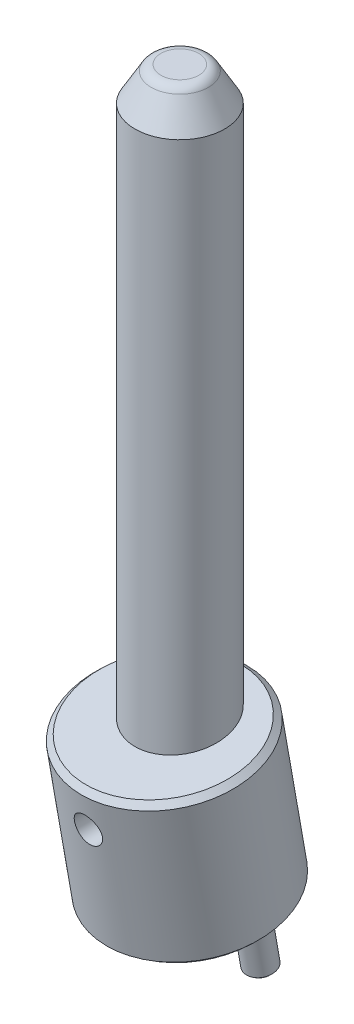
ISO-10303-21;
HEADER;
FILE_DESCRIPTION(('STEP AP214'),'2;1');
FILE_NAME('part.step','',(''),(''),'','','');
FILE_SCHEMA(('AUTOMOTIVE_DESIGN { 1 0 10303 214 1 1 1 1 }'));
ENDSEC;
DATA;
#1=APPLICATION_CONTEXT('core data for automotive mechanical design processes');
#2=APPLICATION_PROTOCOL_DEFINITION('international standard','automotive_design',2000,#1);
#3=PRODUCT_CONTEXT('',#1,'mechanical');
#4=PRODUCT('Part','Part','',(#3));
#5=PRODUCT_RELATED_PRODUCT_CATEGORY('part','',(#4));
#6=PRODUCT_DEFINITION_FORMATION('','',#4);
#7=PRODUCT_DEFINITION_CONTEXT('part definition',#1,'design');
#8=PRODUCT_DEFINITION('design','',#6,#7);
#9=PRODUCT_DEFINITION_SHAPE('','',#8);
#10=(LENGTH_UNIT() NAMED_UNIT(*) SI_UNIT(.MILLI.,.METRE.));
#11=(NAMED_UNIT(*) PLANE_ANGLE_UNIT() SI_UNIT($,.RADIAN.));
#12=(NAMED_UNIT(*) SI_UNIT($,.STERADIAN.) SOLID_ANGLE_UNIT());
#13=UNCERTAINTY_MEASURE_WITH_UNIT(LENGTH_MEASURE(1.E-05),#10,'distance_accuracy_value','');
#14=(GEOMETRIC_REPRESENTATION_CONTEXT(3) GLOBAL_UNCERTAINTY_ASSIGNED_CONTEXT((#13)) GLOBAL_UNIT_ASSIGNED_CONTEXT((#10,
#11,#12)) REPRESENTATION_CONTEXT('',''));
#15=CARTESIAN_POINT('',(0.,0.,0.));
#16=DIRECTION('',(0.,0.,1.));
#17=DIRECTION('',(1.,0.,0.));
#18=AXIS2_PLACEMENT_3D('',#15,#16,#17);
#19=CARTESIAN_POINT('',(0.,-11.4816197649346,-3.21008704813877));
#20=DIRECTION('',(0.,-0.984807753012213,-0.173648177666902));
#21=DIRECTION('',(0.,0.173648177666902,-0.984807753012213));
#22=AXIS2_PLACEMENT_3D('',#19,#20,#21);
#23=PLANE('',#22);
#24=CARTESIAN_POINT('',(-11.25,-11.4816197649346,-3.21008704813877));
#25=DIRECTION('',(0.,-0.984807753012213,-0.173648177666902));
#26=DIRECTION('',(0.,0.173648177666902,-0.984807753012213));
#27=AXIS2_PLACEMENT_3D('',#24,#25,#26);
#28=CIRCLE('',#27,1.9999654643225);
#29=CARTESIAN_POINT('',(-11.25,-11.1343294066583,-5.17966854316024));
#30=VERTEX_POINT('',#29);
#31=EDGE_CURVE('P0_E17',#30,#30,#28,.F.);
#32=ORIENTED_EDGE('',*,*,#31,.F.);
#33=EDGE_LOOP('',(#32));
#34=FACE_BOUND('',#33,.T.);
#35=ADVANCED_FACE('P0_F14',(#34),#23,.T.);
#36=CARTESIAN_POINT('',(0.,-11.4816197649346,-3.21008704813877));
#37=DIRECTION('',(0.,-0.984807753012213,-0.173648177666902));
#38=DIRECTION('',(0.,0.173648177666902,-0.984807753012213));
#39=AXIS2_PLACEMENT_3D('',#36,#37,#38);
#40=PLANE('',#39);
#41=CARTESIAN_POINT('',(11.25,-11.4816197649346,-3.21008704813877));
#42=DIRECTION('',(0.,-0.984807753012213,-0.173648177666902));
#43=DIRECTION('',(0.,0.173648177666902,-0.984807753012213));
#44=AXIS2_PLACEMENT_3D('',#41,#42,#43);
#45=CIRCLE('',#44,1.99996546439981);
#46=CARTESIAN_POINT('',(11.25,-11.1343294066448,-5.17966854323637));
#47=VERTEX_POINT('',#46);
#48=EDGE_CURVE('P0_E114',#47,#47,#45,.F.);
#49=ORIENTED_EDGE('',*,*,#48,.F.);
#50=EDGE_LOOP('',(#49));
#51=FACE_BOUND('',#50,.T.);
#52=ADVANCED_FACE('P0_F104',(#51),#40,.T.);
#53=CARTESIAN_POINT('',(0.,-2.78423117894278E-13,0.));
#54=DIRECTION('',(0.,-1.,0.));
#55=DIRECTION('',(0.,0.,-1.));
#56=AXIS2_PLACEMENT_3D('',#53,#54,#55);
#57=PLANE('',#56);
#58=CARTESIAN_POINT('',(0.,-1.8474805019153E-13,-1.19479079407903E-13));
#59=DIRECTION('',(0.,-1.,0.));
#60=DIRECTION('',(0.,0.,-1.));
#61=AXIS2_PLACEMENT_3D('',#58,#59,#60);
#62=CIRCLE('',#61,8.);
#63=CARTESIAN_POINT('',(0.,-1.8474805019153E-13,-8.00000000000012));
#64=VERTEX_POINT('',#63);
#65=EDGE_CURVE('P0_E116',#64,#64,#62,.F.);
#66=ORIENTED_EDGE('',*,*,#65,.T.);
#67=EDGE_LOOP('',(#66));
#68=FACE_BOUND('',#67,.T.);
#69=ADVANCED_FACE('P0_F101',(#68),#57,.F.);
#70=CARTESIAN_POINT('',(-11.25,-10.9891918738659,-3.12325872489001));
#71=DIRECTION('',(0.,0.984807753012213,0.173648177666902));
#72=DIRECTION('',(0.,-0.173648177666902,0.984807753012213));
#73=AXIS2_PLACEMENT_3D('',#70,#71,#72);
#74=CONICAL_SURFACE('',#73,2.49998121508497,0.78538952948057);
#75=CARTESIAN_POINT('',(-11.25,-10.9891733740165,-3.12325546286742));
#76=DIRECTION('',(0.,0.984807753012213,0.173648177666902));
#77=DIRECTION('',(0.,-0.173648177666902,0.984807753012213));
#78=AXIS2_PLACEMENT_3D('',#75,#76,#77);
#79=CIRCLE('',#78,2.5);
#80=CARTESIAN_POINT('',(-11.25,-11.4232938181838,-0.661236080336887));
#81=VERTEX_POINT('',#80);
#82=EDGE_CURVE('P0_E118',#81,#81,#79,.T.);
#83=ORIENTED_EDGE('',*,*,#82,.F.);
#84=EDGE_LOOP('',(#83));
#85=FACE_BOUND('',#84,.T.);
#86=ORIENTED_EDGE('',*,*,#31,.T.);
#87=EDGE_LOOP('',(#86));
#88=FACE_BOUND('',#87,.T.);
#89=ADVANCED_FACE('P0_F97',(#85,#88),#74,.T.);
#90=CARTESIAN_POINT('',(11.25,-10.9891918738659,-3.12325872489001));
#91=DIRECTION('',(0.,0.984807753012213,0.173648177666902));
#92=DIRECTION('',(0.,-0.173648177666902,0.984807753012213));
#93=AXIS2_PLACEMENT_3D('',#90,#91,#92);
#94=CONICAL_SURFACE('',#93,2.49998121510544,0.785389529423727);
#95=CARTESIAN_POINT('',(11.25,-10.9891733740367,-3.12325546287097));
#96=DIRECTION('',(0.,0.984807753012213,0.173648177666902));
#97=DIRECTION('',(0.,-0.173648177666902,0.984807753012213));
#98=AXIS2_PLACEMENT_3D('',#95,#96,#97);
#99=CIRCLE('',#98,2.5);
#100=CARTESIAN_POINT('',(11.25,-11.4232938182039,-0.66123608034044));
#101=VERTEX_POINT('',#100);
#102=EDGE_CURVE('P0_E123',#101,#101,#99,.T.);
#103=ORIENTED_EDGE('',*,*,#102,.F.);
#104=EDGE_LOOP('',(#103));
#105=FACE_BOUND('',#104,.T.);
#106=ORIENTED_EDGE('',*,*,#48,.T.);
#107=EDGE_LOOP('',(#106));
#108=FACE_BOUND('',#107,.T.);
#109=ADVANCED_FACE('P0_F92',(#105,#108),#94,.T.);
#110=CARTESIAN_POINT('',(0.,28.8048886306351,-1.196959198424E-13));
#111=DIRECTION('',(0.,-1.,0.));
#112=DIRECTION('',(0.,0.,-1.));
#113=AXIS2_PLACEMENT_3D('',#110,#111,#112);
#114=CYLINDRICAL_SURFACE('',#113,8.);
#115=CARTESIAN_POINT('',(0.,23.9999999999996,-1.196959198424E-13));
#116=DIRECTION('',(0.,0.984807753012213,0.173648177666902));
#117=DIRECTION('',(0.,-0.173648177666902,0.984807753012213));
#118=AXIS2_PLACEMENT_3D('',#115,#116,#117);
#119=ELLIPSE('',#118,8.12341289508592,8.);
#120=CARTESIAN_POINT('',(0.,22.5893841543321,7.99999999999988));
#121=VERTEX_POINT('',#120);
#122=EDGE_CURVE('P0_E79',#121,#121,#119,.F.);
#123=ORIENTED_EDGE('',*,*,#122,.F.);
#124=EDGE_LOOP('',(#123));
#125=FACE_BOUND('',#124,.T.);
#126=ORIENTED_EDGE('',*,*,#65,.F.);
#127=EDGE_LOOP('',(#126));
#128=FACE_BOUND('',#127,.T.);
#129=CARTESIAN_POINT('',(0.,16.4999999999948,7.99999999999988));
#130=CARTESIAN_POINT('',(-0.136696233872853,16.499992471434,7.99999486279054));
#131=CARTESIAN_POINT('',(-0.273538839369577,16.488736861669,7.99645812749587));
#132=CARTESIAN_POINT('',(-0.543359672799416,16.444079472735,7.98267442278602));
#133=CARTESIAN_POINT('',(-0.676330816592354,16.4106394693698,7.9724158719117));
#134=CARTESIAN_POINT('',(-0.934271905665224,16.3228538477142,7.94631394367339));
#135=CARTESIAN_POINT('',(-1.05925832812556,16.2685530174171,7.93048253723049));
#136=CARTESIAN_POINT('',(-1.2983071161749,16.1407422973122,7.89487323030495));
#137=CARTESIAN_POINT('',(-1.4123711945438,16.0672354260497,7.87509595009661));
#138=CARTESIAN_POINT('',(-1.62992724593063,15.9006902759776,7.83300483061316));
#139=CARTESIAN_POINT('',(-1.73303436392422,15.8071632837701,7.81063552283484));
#140=CARTESIAN_POINT('',(-1.92239021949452,15.6042691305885,7.76620212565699));
#141=CARTESIAN_POINT('',(-2.00863490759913,15.4948981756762,7.74413811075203));
#142=CARTESIAN_POINT('',(-2.16388692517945,15.2601105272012,7.7022228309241));
#143=CARTESIAN_POINT('',(-2.23241606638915,15.1343643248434,7.68243965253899));
#144=CARTESIAN_POINT('',(-2.34719509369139,14.8724145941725,7.6481559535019));
#145=CARTESIAN_POINT('',(-2.3934509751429,14.7362138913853,7.63365401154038));
#146=CARTESIAN_POINT('',(-2.4609691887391,14.4615438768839,7.61215214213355));
#147=CARTESIAN_POINT('',(-2.48294218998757,14.3232663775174,7.60493946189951));
#148=CARTESIAN_POINT('',(-2.50349110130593,14.0448138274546,7.59820110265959));
#149=CARTESIAN_POINT('',(-2.50207322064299,13.9046392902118,7.59867338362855));
#150=CARTESIAN_POINT('',(-2.47643652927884,13.6322514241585,7.60706377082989));
#151=CARTESIAN_POINT('',(-2.45312128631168,13.4999424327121,7.61468679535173));
#152=CARTESIAN_POINT('',(-2.38581648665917,13.2412163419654,7.63604044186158));
#153=CARTESIAN_POINT('',(-2.34182462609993,13.1147999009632,7.64977174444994));
#154=CARTESIAN_POINT('',(-2.23377596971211,12.8692925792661,7.68202134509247));
#155=CARTESIAN_POINT('',(-2.16943495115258,12.7503359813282,7.70060675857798));
#156=CARTESIAN_POINT('',(-2.02271557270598,12.5246183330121,7.74043834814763));
#157=CARTESIAN_POINT('',(-1.94033355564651,12.4178597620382,7.76168506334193));
#158=CARTESIAN_POINT('',(-1.75545127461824,12.2144687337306,7.80562654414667));
#159=CARTESIAN_POINT('',(-1.65220788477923,12.1185153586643,7.82834327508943));
#160=CARTESIAN_POINT('',(-1.43076939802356,11.9450838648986,7.87182395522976));
#161=CARTESIAN_POINT('',(-1.31256787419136,11.8676137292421,7.89258705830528));
#162=CARTESIAN_POINT('',(-1.06322528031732,11.7328853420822,7.93004255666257));
#163=CARTESIAN_POINT('',(-0.931982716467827,11.6758045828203,7.94669883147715));
#164=CARTESIAN_POINT('',(-0.661263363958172,11.5848318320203,7.97377752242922));
#165=CARTESIAN_POINT('',(-0.521804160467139,11.5508921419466,7.98421275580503));
#166=CARTESIAN_POINT('',(-0.317572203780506,11.5194323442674,7.99394471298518));
#167=CARTESIAN_POINT('',(-0.25430866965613,11.5121536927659,7.99620897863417));
#168=CARTESIAN_POINT('',(-0.127374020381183,11.5024357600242,7.99923782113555));
#169=CARTESIAN_POINT('',(-0.0637029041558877,11.4999964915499,8.00000239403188));
#170=CARTESIAN_POINT('',(0.136696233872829,11.5000075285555,7.9999948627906));
#171=CARTESIAN_POINT('',(0.273538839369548,11.5112631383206,7.99645812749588));
#172=CARTESIAN_POINT('',(0.543359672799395,11.5559205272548,7.982674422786));
#173=CARTESIAN_POINT('',(0.676330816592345,11.5893605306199,7.9724158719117));
#174=CARTESIAN_POINT('',(0.934271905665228,11.6771461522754,7.94631394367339));
#175=CARTESIAN_POINT('',(1.05925832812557,11.7314469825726,7.93048253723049));
#176=CARTESIAN_POINT('',(1.2983071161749,11.8592577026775,7.89487323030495));
#177=CARTESIAN_POINT('',(1.4123711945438,11.93276457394,7.87509595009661));
#178=CARTESIAN_POINT('',(1.62992724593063,12.099309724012,7.83300483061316));
#179=CARTESIAN_POINT('',(1.73303436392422,12.1928367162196,7.81063552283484));
#180=CARTESIAN_POINT('',(1.92239021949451,12.3957308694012,7.76620212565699));
#181=CARTESIAN_POINT('',(2.00863490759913,12.5051018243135,7.74413811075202));
#182=CARTESIAN_POINT('',(2.16388692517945,12.7398894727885,7.7022228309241));
#183=CARTESIAN_POINT('',(2.23241606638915,12.8656356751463,7.68243965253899));
#184=CARTESIAN_POINT('',(2.34719509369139,13.1275854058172,7.6481559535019));
#185=CARTESIAN_POINT('',(2.3934509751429,13.2637861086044,7.63365401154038));
#186=CARTESIAN_POINT('',(2.4609691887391,13.5384561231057,7.61215214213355));
#187=CARTESIAN_POINT('',(2.48294218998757,13.6767336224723,7.60493946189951));
#188=CARTESIAN_POINT('',(2.50349110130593,13.9551861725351,7.5982011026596));
#189=CARTESIAN_POINT('',(2.50207322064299,14.0953607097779,7.59867338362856));
#190=CARTESIAN_POINT('',(2.47643652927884,14.3677485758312,7.60706377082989));
#191=CARTESIAN_POINT('',(2.45312128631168,14.5000575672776,7.61468679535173));
#192=CARTESIAN_POINT('',(2.38581648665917,14.7587836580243,7.63604044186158));
#193=CARTESIAN_POINT('',(2.34182462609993,14.8852000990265,7.64977174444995));
#194=CARTESIAN_POINT('',(2.23377596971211,15.1307074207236,7.68202134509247));
#195=CARTESIAN_POINT('',(2.16943495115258,15.2496640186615,7.70060675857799));
#196=CARTESIAN_POINT('',(2.02271557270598,15.4753816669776,7.74043834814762));
#197=CARTESIAN_POINT('',(1.94033355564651,15.5821402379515,7.76168506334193));
#198=CARTESIAN_POINT('',(1.75545127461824,15.785531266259,7.80562654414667));
#199=CARTESIAN_POINT('',(1.65220788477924,15.8814846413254,7.82834327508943));
#200=CARTESIAN_POINT('',(1.43076939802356,16.054916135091,7.87182395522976));
#201=CARTESIAN_POINT('',(1.31256787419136,16.1323862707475,7.89258705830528));
#202=CARTESIAN_POINT('',(1.06322528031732,16.2671146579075,7.93004255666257));
#203=CARTESIAN_POINT('',(0.93198271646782,16.3241954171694,7.94669883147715));
#204=CARTESIAN_POINT('',(0.661263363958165,16.4151681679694,7.97377752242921));
#205=CARTESIAN_POINT('',(0.521804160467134,16.449107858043,7.98421275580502));
#206=CARTESIAN_POINT('',(0.317572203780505,16.4805676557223,7.99394471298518));
#207=CARTESIAN_POINT('',(0.254308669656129,16.4878463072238,7.99620897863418));
#208=CARTESIAN_POINT('',(0.127374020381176,16.4975642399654,7.99923782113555));
#209=CARTESIAN_POINT('',(0.0637029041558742,16.5000035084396,8.00000239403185));
#210=CARTESIAN_POINT('',(0.,16.4999999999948,7.99999999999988));
#211=B_SPLINE_CURVE_WITH_KNOTS('',3,(#129,#130,#131,#132,#133,#134,#135,#136,#137,#138,#139,
#140,#141,#142,#143,#144,#145,#146,#147,#148,#149,#150,#151,#152,#153,#154,#155,#156,#157,#158,
#159,#160,#161,#162,#163,#164,#165,#166,#167,#168,#169,#170,#171,#172,#173,#174,#175,#176,#177,
#178,#179,#180,#181,#182,#183,#184,#185,#186,#187,#188,#189,#190,#191,#192,#193,#194,#195,#196,
#197,#198,#199,#200,#201,#202,#203,#204,#205,#206,#207,#208,#209,#210),.UNSPECIFIED.,.T.,.F.,(4,
2,2,2,2,2,2,2,2,2,2,2,2,2,2,2,2,2,2,2,2,2,2,2,2,2,2,2,2,2,2,2,2,2,2,2,2,2,2,2,4),(0.,
0.409843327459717,0.820394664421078,1.23006943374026,1.63967985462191,2.06074511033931,
2.48191136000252,2.91347666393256,3.34492573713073,3.76338291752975,4.18172901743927,
4.58353732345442,4.9853904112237,5.39312450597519,5.80094133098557,6.22725884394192,
6.65376015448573,7.08388858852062,7.51312773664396,7.70412159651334,7.89511596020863,
8.30495928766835,8.71551062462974,9.12518539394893,9.53479581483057,9.95586107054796,
10.3770273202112,10.8085926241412,11.2400416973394,11.6584988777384,12.0768449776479,
12.4786532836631,12.8805063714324,13.2882404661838,13.6960572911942,14.1223748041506,
14.5488761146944,14.9790045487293,15.4082436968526,15.599237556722,15.7902319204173),.UNSPECIFIED.);
#212=CARTESIAN_POINT('',(0.,16.4999999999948,7.99999999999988));
#213=VERTEX_POINT('',#212);
#214=EDGE_CURVE('P0_E76',#213,#213,#211,.T.);
#215=ORIENTED_EDGE('',*,*,#214,.T.);
#216=EDGE_LOOP('',(#215));
#217=FACE_BOUND('',#216,.T.);
#218=ADVANCED_FACE('P0_F86',(#125,#128,#217),#114,.F.);
#219=CARTESIAN_POINT('',(-11.25,-4.095561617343,-1.907725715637));
#220=DIRECTION('',(0.,-0.984807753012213,-0.173648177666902));
#221=DIRECTION('',(0.,0.173648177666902,-0.984807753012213));
#222=AXIS2_PLACEMENT_3D('',#219,#220,#221);
#223=CYLINDRICAL_SURFACE('',#222,2.5);
#224=CARTESIAN_POINT('',(-11.25,-4.095561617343,-1.907725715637));
#225=DIRECTION('',(0.,-0.984807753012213,-0.173648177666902));
#226=DIRECTION('',(0.,0.173648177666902,-0.984807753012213));
#227=AXIS2_PLACEMENT_3D('',#224,#225,#226);
#228=CIRCLE('',#227,2.5);
#229=CARTESIAN_POINT('',(-11.25,-3.66144117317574,-4.36974509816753));
#230=VERTEX_POINT('',#229);
#231=EDGE_CURVE('P0_E72',#230,#230,#228,.T.);
#232=ORIENTED_EDGE('',*,*,#231,.T.);
#233=EDGE_LOOP('',(#232));
#234=FACE_BOUND('',#233,.T.);
#235=ORIENTED_EDGE('',*,*,#82,.T.);
#236=EDGE_LOOP('',(#235));
#237=FACE_BOUND('',#236,.T.);
#238=ADVANCED_FACE('P0_F91',(#234,#237),#223,.T.);
#239=CARTESIAN_POINT('',(11.25,-4.095561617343,-1.907725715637));
#240=DIRECTION('',(0.,-0.984807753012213,-0.173648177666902));
#241=DIRECTION('',(0.,0.173648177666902,-0.984807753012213));
#242=AXIS2_PLACEMENT_3D('',#239,#240,#241);
#243=CYLINDRICAL_SURFACE('',#242,2.5);
#244=CARTESIAN_POINT('',(11.25,-4.095561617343,-1.907725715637));
#245=DIRECTION('',(0.,-0.984807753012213,-0.173648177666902));
#246=DIRECTION('',(0.,0.173648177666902,-0.984807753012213));
#247=AXIS2_PLACEMENT_3D('',#244,#245,#246);
#248=CIRCLE('',#247,2.5);
#249=CARTESIAN_POINT('',(11.25,-3.66144117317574,-4.36974509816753));
#250=VERTEX_POINT('',#249);
#251=EDGE_CURVE('P0_E68',#250,#250,#248,.T.);
#252=ORIENTED_EDGE('',*,*,#251,.T.);
#253=EDGE_LOOP('',(#252));
#254=FACE_BOUND('',#253,.T.);
#255=ORIENTED_EDGE('',*,*,#102,.T.);
#256=EDGE_LOOP('',(#255));
#257=FACE_BOUND('',#256,.T.);
#258=ADVANCED_FACE('P0_F139',(#254,#257),#243,.T.);
#259=CARTESIAN_POINT('',(0.,23.479055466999,2.95442325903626));
#260=DIRECTION('',(0.,0.984807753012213,0.173648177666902));
#261=DIRECTION('',(0.,-0.173648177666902,0.984807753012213));
#262=AXIS2_PLACEMENT_3D('',#259,#260,#261);
#263=PLANE('',#262);
#264=ORIENTED_EDGE('',*,*,#122,.T.);
#265=EDGE_LOOP('',(#264));
#266=FACE_BOUND('',#265,.T.);
#267=CARTESIAN_POINT('',(0.,23.479054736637,2.95442313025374));
#268=DIRECTION('',(0.,-0.984807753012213,-0.173648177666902));
#269=DIRECTION('',(0.,0.173648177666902,-0.984807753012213));
#270=AXIS2_PLACEMENT_3D('',#267,#268,#269);
#271=CIRCLE('',#270,13.999998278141);
#272=CARTESIAN_POINT('',(0.,25.9101289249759,-10.8328837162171));
#273=VERTEX_POINT('',#272);
#274=EDGE_CURVE('P0_E38',#273,#273,#271,.T.);
#275=ORIENTED_EDGE('',*,*,#274,.F.);
#276=EDGE_LOOP('',(#275));
#277=FACE_BOUND('',#276,.T.);
#278=ADVANCED_FACE('P0_F63',(#266,#277),#263,.T.);
#279=CARTESIAN_POINT('',(0.,13.9999999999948,-2.85095709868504));
#280=DIRECTION('',(0.,0.,1.));
#281=DIRECTION('',(0.,-1.,0.));
#282=AXIS2_PLACEMENT_3D('',#279,#280,#281);
#283=CYLINDRICAL_SURFACE('',#282,2.5);
#284=ORIENTED_EDGE('',*,*,#214,.F.);
#285=EDGE_LOOP('',(#284));
#286=FACE_BOUND('',#285,.T.);
#287=CARTESIAN_POINT('',(0.,11.4999999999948,16.0735917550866));
#288=CARTESIAN_POINT('',(-0.14028096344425,11.500006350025,16.0735900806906));
#289=CARTESIAN_POINT('',(-0.280731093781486,11.5118534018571,16.0736614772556));
#290=CARTESIAN_POINT('',(-0.557836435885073,11.5589676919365,16.0741066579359));
#291=CARTESIAN_POINT('',(-0.694483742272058,11.5942803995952,16.0744810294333));
#292=CARTESIAN_POINT('',(-0.959831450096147,11.6873256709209,16.0760056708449));
#293=CARTESIAN_POINT('',(-1.08853741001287,11.7450423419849,16.0771553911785));
#294=CARTESIAN_POINT('',(-1.33436133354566,11.8812222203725,16.0809429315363));
#295=CARTESIAN_POINT('',(-1.45148422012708,11.9596765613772,16.0835801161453));
#296=CARTESIAN_POINT('',(-1.67074068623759,12.1349794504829,16.0911937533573));
#297=CARTESIAN_POINT('',(-1.77289134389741,12.2318067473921,16.0961675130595));
#298=CARTESIAN_POINT('',(-1.95944906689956,12.4410871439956,16.1093185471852));
#299=CARTESIAN_POINT('',(-2.0438557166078,12.5535406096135,16.1174958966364));
#300=CARTESIAN_POINT('',(-2.19218872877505,12.7901597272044,16.1377347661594));
#301=CARTESIAN_POINT('',(-2.25621082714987,12.9142669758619,16.1497775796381));
#302=CARTESIAN_POINT('',(-2.36262391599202,13.1709574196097,16.1782032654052));
#303=CARTESIAN_POINT('',(-2.40501571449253,13.3035402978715,16.1945859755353));
#304=CARTESIAN_POINT('',(-2.46720265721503,13.5732998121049,16.2317591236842));
#305=CARTESIAN_POINT('',(-2.48699713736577,13.710476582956,16.2525496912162));
#306=CARTESIAN_POINT('',(-2.50375379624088,13.9855413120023,16.2981803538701));
#307=CARTESIAN_POINT('',(-2.50071393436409,14.1234293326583,16.3230208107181));
#308=CARTESIAN_POINT('',(-2.47196381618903,14.3985683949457,16.3764421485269));
#309=CARTESIAN_POINT('',(-2.44586331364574,14.5357673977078,16.4050801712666));
#310=CARTESIAN_POINT('',(-2.3714359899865,14.8034963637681,16.4645822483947));
#311=CARTESIAN_POINT('',(-2.32310495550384,14.9340250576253,16.4954467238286));
#312=CARTESIAN_POINT('',(-2.2039326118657,15.1886963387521,16.5588304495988));
#313=CARTESIAN_POINT('',(-2.1324933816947,15.3125539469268,16.5913718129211));
#314=CARTESIAN_POINT('',(-1.96944114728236,15.5464901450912,16.6554724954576));
#315=CARTESIAN_POINT('',(-1.87782721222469,15.6565680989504,16.6870317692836));
#316=CARTESIAN_POINT('',(-1.67579408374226,15.8607856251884,16.7475187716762));
#317=CARTESIAN_POINT('',(-1.5652168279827,15.9547767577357,16.7764209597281));
#318=CARTESIAN_POINT('',(-1.32860824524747,16.1226950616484,16.8293110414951));
#319=CARTESIAN_POINT('',(-1.20257266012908,16.196616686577,16.8532975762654));
#320=CARTESIAN_POINT('',(-0.942801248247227,16.3197303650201,16.8938812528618));
#321=CARTESIAN_POINT('',(-0.80943048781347,16.3696247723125,16.9106863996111));
#322=CARTESIAN_POINT('',(-0.535662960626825,16.4460500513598,16.9366302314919));
#323=CARTESIAN_POINT('',(-0.395285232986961,16.4726409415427,16.9457886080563));
#324=CARTESIAN_POINT('',(-0.211603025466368,16.491391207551,16.9522540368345));
#325=CARTESIAN_POINT('',(-0.169359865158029,16.494616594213,16.9533671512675));
#326=CARTESIAN_POINT('',(-0.0847506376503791,16.4989220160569,16.9548540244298));
#327=CARTESIAN_POINT('',(-0.0423845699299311,16.5000020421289,16.9552277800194));
#328=CARTESIAN_POINT('',(0.135304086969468,16.4999934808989,16.9552230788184));
#329=CARTESIAN_POINT('',(0.270796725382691,16.4889598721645,16.9513992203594));
#330=CARTESIAN_POINT('',(0.537993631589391,16.4451923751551,16.936370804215));
#331=CARTESIAN_POINT('',(0.669689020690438,16.4124113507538,16.9251502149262));
#332=CARTESIAN_POINT('',(0.925125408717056,16.3264246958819,16.8961779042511));
#333=CARTESIAN_POINT('',(1.04888412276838,16.2732665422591,16.8784413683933));
#334=CARTESIAN_POINT('',(1.28555274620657,16.1483173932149,16.8376538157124));
#335=CARTESIAN_POINT('',(1.39846597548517,16.0765321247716,16.8146044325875));
#336=CARTESIAN_POINT('',(1.6140136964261,15.914079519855,16.7638936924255));
#337=CARTESIAN_POINT('',(1.71625023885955,15.8229206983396,16.7361170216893));
#338=CARTESIAN_POINT('',(1.90422089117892,15.6255846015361,16.6781186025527));
#339=CARTESIAN_POINT('',(1.98994992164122,15.5194027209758,16.6478961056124));
#340=CARTESIAN_POINT('',(2.14645691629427,15.2895430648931,16.5852625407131));
#341=CARTESIAN_POINT('',(2.2163735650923,15.165287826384,16.5528145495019));
#342=CARTESIAN_POINT('',(2.33419089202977,14.9065140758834,16.4888276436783));
#343=CARTESIAN_POINT('',(2.38208944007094,14.7719945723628,16.4572888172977));
#344=CARTESIAN_POINT('',(2.45483477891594,14.4945625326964,16.3963047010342));
#345=CARTESIAN_POINT('',(2.47939621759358,14.3515682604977,16.3668892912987));
#346=CARTESIAN_POINT('',(2.50340717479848,14.0627629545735,16.3118591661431));
#347=CARTESIAN_POINT('',(2.5028603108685,13.9169523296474,16.2862439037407));
#348=CARTESIAN_POINT('',(2.47659040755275,13.6301885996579,16.2401687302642));
#349=CARTESIAN_POINT('',(2.45143589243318,13.4892001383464,16.2196055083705));
#350=CARTESIAN_POINT('',(2.37720714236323,13.2130300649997,16.1832005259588));
#351=CARTESIAN_POINT('',(2.32813620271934,13.0778476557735,16.1673581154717));
#352=CARTESIAN_POINT('',(2.20887450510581,12.8208320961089,16.1405589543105));
#353=CARTESIAN_POINT('',(2.13925039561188,12.6987474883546,16.1294885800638));
#354=CARTESIAN_POINT('',(1.98039075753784,12.4677817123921,16.1111246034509));
#355=CARTESIAN_POINT('',(1.89115745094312,12.3588990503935,16.1038305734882));
#356=CARTESIAN_POINT('',(1.69631696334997,12.1582819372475,16.0922800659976));
#357=CARTESIAN_POINT('',(1.59083189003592,12.0664300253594,16.0880021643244));
#358=CARTESIAN_POINT('',(1.36594440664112,11.901514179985,16.0815383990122));
#359=CARTESIAN_POINT('',(1.24653590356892,11.8284585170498,16.0793534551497));
#360=CARTESIAN_POINT('',(0.996602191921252,11.7029475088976,16.0762570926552));
#361=CARTESIAN_POINT('',(0.866024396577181,11.6505969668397,16.0753520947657));
#362=CARTESIAN_POINT('',(0.598112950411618,11.56857653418,16.0741765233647));
#363=CARTESIAN_POINT('',(0.460792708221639,11.5388634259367,16.0739047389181));
#364=CARTESIAN_POINT('',(0.268718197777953,11.5138980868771,16.0736956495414));
#365=CARTESIAN_POINT('',(0.215114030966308,11.5086904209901,16.0736554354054));
#366=CARTESIAN_POINT('',(0.107681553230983,11.5017401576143,16.0736038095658));
#367=CARTESIAN_POINT('',(0.0538532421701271,11.4999975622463,16.0735923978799));
#368=CARTESIAN_POINT('',(0.,11.4999999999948,16.0735917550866));
#369=B_SPLINE_CURVE_WITH_KNOTS('',3,(#287,#288,#289,#290,#291,#292,#293,#294,#295,#296,#297,
#298,#299,#300,#301,#302,#303,#304,#305,#306,#307,#308,#309,#310,#311,#312,#313,#314,#315,#316,
#317,#318,#319,#320,#321,#322,#323,#324,#325,#326,#327,#328,#329,#330,#331,#332,#333,#334,#335,
#336,#337,#338,#339,#340,#341,#342,#343,#344,#345,#346,#347,#348,#349,#350,#351,#352,#353,#354,
#355,#356,#357,#358,#359,#360,#361,#362,#363,#364,#365,#366,#367,#368),.UNSPECIFIED.,.T.,.F.,(4,
2,2,2,2,2,2,2,2,2,2,2,2,2,2,2,2,2,2,2,2,2,2,2,2,2,2,2,2,2,2,2,2,2,2,2,2,2,2,2,4),(0.,
0.420640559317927,0.842098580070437,1.26325817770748,1.68423800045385,2.10473383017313,
2.52523950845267,2.94374011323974,3.36222508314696,3.78072235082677,4.19925701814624,
4.62501301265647,5.0508497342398,5.48872876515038,5.92662800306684,6.36837236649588,
6.81023868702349,7.23825835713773,7.665172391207,7.7922731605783,7.91937446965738,
8.32511945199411,8.73174674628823,9.13743233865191,9.54299334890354,9.96043363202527,
10.3780021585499,10.8146353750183,11.2513108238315,11.6932594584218,12.1351444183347,
12.5670556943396,12.9989074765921,13.4198168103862,13.8406784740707,14.2585197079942,
14.6765444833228,15.0966588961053,15.5159692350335,15.6774511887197,15.8389332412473),.UNSPECIFIED.);
#370=CARTESIAN_POINT('',(0.,11.4999999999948,16.0735917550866));
#371=VERTEX_POINT('',#370);
#372=EDGE_CURVE('P0_E31',#371,#371,#369,.T.);
#373=ORIENTED_EDGE('',*,*,#372,.F.);
#374=EDGE_LOOP('',(#373));
#375=FACE_BOUND('',#374,.T.);
#376=ADVANCED_FACE('P0_F40',(#286,#375),#283,.F.);
#377=CARTESIAN_POINT('',(0.,-4.095561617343,-1.907725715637));
#378=DIRECTION('',(0.,0.984807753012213,0.173648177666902));
#379=DIRECTION('',(0.,-0.173648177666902,0.984807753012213));
#380=AXIS2_PLACEMENT_3D('',#377,#378,#379);
#381=PLANE('',#380);
#382=ORIENTED_EDGE('',*,*,#251,.F.);
#383=EDGE_LOOP('',(#382));
#384=FACE_BOUND('',#383,.T.);
#385=ORIENTED_EDGE('',*,*,#231,.F.);
#386=EDGE_LOOP('',(#385));
#387=FACE_BOUND('',#386,.T.);
#388=CARTESIAN_POINT('',(0.,-4.09556086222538,-1.9077255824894));
#389=DIRECTION('',(0.,0.984807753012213,0.173648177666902));
#390=DIRECTION('',(0.,-0.173648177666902,0.984807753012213));
#391=AXIS2_PLACEMENT_3D('',#388,#389,#390);
#392=CIRCLE('',#391,13.99999802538);
#393=CARTESIAN_POINT('',(0.,-6.52663500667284,11.8795810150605));
#394=VERTEX_POINT('',#393);
#395=EDGE_CURVE('P0_E26',#394,#394,#392,.T.);
#396=ORIENTED_EDGE('',*,*,#395,.F.);
#397=EDGE_LOOP('',(#396));
#398=FACE_BOUND('',#397,.T.);
#399=ADVANCED_FACE('P0_F55',(#384,#387,#398),#381,.F.);
#400=CARTESIAN_POINT('',(0.,22.4942458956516,2.78077476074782));
#401=DIRECTION('',(0.,-0.984807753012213,-0.173648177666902));
#402=DIRECTION('',(0.,0.173648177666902,-0.984807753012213));
#403=AXIS2_PLACEMENT_3D('',#400,#401,#402);
#404=CONICAL_SURFACE('',#403,14.999999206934,0.785398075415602);
#405=ORIENTED_EDGE('',*,*,#274,.T.);
#406=EDGE_LOOP('',(#405));
#407=FACE_BOUND('',#406,.T.);
#408=CARTESIAN_POINT('',(0.,22.4942466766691,2.78077489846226));
#409=DIRECTION('',(0.,0.984807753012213,0.173648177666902));
#410=DIRECTION('',(0.,-0.173648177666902,0.984807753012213));
#411=AXIS2_PLACEMENT_3D('',#408,#409,#410);
#412=CIRCLE('',#411,15.);
#413=CARTESIAN_POINT('',(0.,19.8895240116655,17.5528911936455));
#414=VERTEX_POINT('',#413);
#415=EDGE_CURVE('P0_E21',#414,#414,#412,.F.);
#416=ORIENTED_EDGE('',*,*,#415,.F.);
#417=EDGE_LOOP('',(#416));
#418=FACE_BOUND('',#417,.T.);
#419=ADVANCED_FACE('P0_F52',(#407,#418),#404,.T.);
#420=CARTESIAN_POINT('',(0.,-3.11075177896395,-1.73407717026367));
#421=DIRECTION('',(0.,0.984807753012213,0.173648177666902));
#422=DIRECTION('',(0.,-0.173648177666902,0.984807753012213));
#423=AXIS2_PLACEMENT_3D('',#420,#421,#422);
#424=CONICAL_SURFACE('',#423,14.9999991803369,0.785398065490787);
#425=CARTESIAN_POINT('',(0.,-3.11075258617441,-1.73407731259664));
#426=DIRECTION('',(0.,0.984807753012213,0.173648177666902));
#427=DIRECTION('',(0.,-0.173648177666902,0.984807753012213));
#428=AXIS2_PLACEMENT_3D('',#425,#426,#427);
#429=CIRCLE('',#428,15.);
#430=CARTESIAN_POINT('',(0.,-5.71547525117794,13.0380389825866));
#431=VERTEX_POINT('',#430);
#432=EDGE_CURVE('P0_E9',#431,#431,#429,.T.);
#433=ORIENTED_EDGE('',*,*,#432,.F.);
#434=EDGE_LOOP('',(#433));
#435=FACE_BOUND('',#434,.T.);
#436=ORIENTED_EDGE('',*,*,#395,.T.);
#437=EDGE_LOOP('',(#436));
#438=FACE_BOUND('',#437,.T.);
#439=ADVANCED_FACE('P0_F48',(#435,#438),#424,.T.);
#440=CARTESIAN_POINT('',(0.,-5.4742924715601,-2.15083316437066));
#441=DIRECTION('',(0.,0.984807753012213,0.173648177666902));
#442=DIRECTION('',(0.,-0.173648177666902,0.984807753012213));
#443=AXIS2_PLACEMENT_3D('',#440,#441,#442);
#444=CYLINDRICAL_SURFACE('',#443,15.);
#445=ORIENTED_EDGE('',*,*,#415,.T.);
#446=EDGE_LOOP('',(#445));
#447=FACE_BOUND('',#446,.T.);
#448=ORIENTED_EDGE('',*,*,#432,.T.);
#449=EDGE_LOOP('',(#448));
#450=FACE_BOUND('',#449,.T.);
#451=ORIENTED_EDGE('',*,*,#372,.T.);
#452=EDGE_LOOP('',(#451));
#453=FACE_BOUND('',#452,.T.);
#454=ADVANCED_FACE('P0_F44',(#447,#450,#453),#444,.T.);
#455=CLOSED_SHELL('',(#35,#52,#69,#89,#109,#218,#238,#258,#278,#376,#399,#419,#439,#454));
#456=MANIFOLD_SOLID_BREP('P0_B1',#455);
#457=CARTESIAN_POINT('',(0.,124.,0.));
#458=DIRECTION('',(0.,1.,0.));
#459=DIRECTION('',(-1.,0.,0.));
#460=AXIS2_PLACEMENT_3D('',#457,#458,#459);
#461=PLANE('',#460);
#462=CARTESIAN_POINT('',(0.,124.,-3.381197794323));
#463=CARTESIAN_POINT('',(0.0491775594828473,124.,-3.38119852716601));
#464=CARTESIAN_POINT('',(0.0983550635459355,124.,-3.38012493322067));
#465=CARTESIAN_POINT('',(0.196616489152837,124.,-3.3758343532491));
#466=CARTESIAN_POINT('',(0.24570041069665,124.,-3.37261736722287));
#467=CARTESIAN_POINT('',(0.343681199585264,124.,-3.36404526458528));
#468=CARTESIAN_POINT('',(0.392578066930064,124.,-3.35869014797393));
#469=CARTESIAN_POINT('',(0.490091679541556,124.,-3.34585220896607));
#470=CARTESIAN_POINT('',(0.538708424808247,124.,-3.33836938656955));
#471=CARTESIAN_POINT('',(0.635569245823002,124.,-3.32129021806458));
#472=CARTESIAN_POINT('',(0.683813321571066,124.,-3.31169387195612));
#473=CARTESIAN_POINT('',(0.779836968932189,124.,-3.29040593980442));
#474=CARTESIAN_POINT('',(0.827616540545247,124.,-3.27871435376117));
#475=CARTESIAN_POINT('',(0.922620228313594,124.,-3.25325819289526));
#476=CARTESIAN_POINT('',(0.969844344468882,124.,-3.2394936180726));
#477=CARTESIAN_POINT('',(1.06364722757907,124.,-3.20991768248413));
#478=CARTESIAN_POINT('',(1.11022599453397,124.,-3.19410632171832));
#479=CARTESIAN_POINT('',(1.2026495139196,124.,-3.1604669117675));
#480=CARTESIAN_POINT('',(1.24849426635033,124.,-3.14263886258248));
#481=CARTESIAN_POINT('',(1.33936248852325,124.,-3.10500001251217));
#482=CARTESIAN_POINT('',(1.38438595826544,124.,-3.08518921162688));
#483=CARTESIAN_POINT('',(1.47352591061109,124.,-3.04362256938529));
#484=CARTESIAN_POINT('',(1.51764239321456,124.,-3.02186672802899));
#485=CARTESIAN_POINT('',(1.60488439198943,124.,-2.97645141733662));
#486=CARTESIAN_POINT('',(1.64800990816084,124.,-2.95279194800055));
#487=CARTESIAN_POINT('',(1.73318788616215,124.,-2.90361442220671));
#488=CARTESIAN_POINT('',(1.77524034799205,124.,-2.87809636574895));
#489=CARTESIAN_POINT('',(1.85819215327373,124.,-2.82525022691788));
#490=CARTESIAN_POINT('',(1.89909149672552,124.,-2.79792214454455));
#491=CARTESIAN_POINT('',(1.97965926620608,124.,-2.74150802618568));
#492=CARTESIAN_POINT('',(2.01932769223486,124.,-2.71242199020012));
#493=CARTESIAN_POINT('',(2.09735790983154,124.,-2.65254713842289));
#494=CARTESIAN_POINT('',(2.13571970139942,123.999999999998,-2.62175832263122));
#495=CARTESIAN_POINT('',(2.21106439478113,124.000000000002,-2.55853724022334));
#496=CARTESIAN_POINT('',(2.24804729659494,124.000000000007,-2.52610497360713));
#497=CARTESIAN_POINT('',(2.32056094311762,123.999999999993,-2.45965603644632));
#498=CARTESIAN_POINT('',(2.35609168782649,123.999999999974,-2.42563936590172));
#499=CARTESIAN_POINT('',(2.42705213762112,124.000000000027,-2.35468855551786));
#500=CARTESIAN_POINT('',(2.46241950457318,124.000000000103,-2.31769205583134));
#501=CARTESIAN_POINT('',(2.53146011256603,123.999999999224,-2.24214947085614));
#502=CARTESIAN_POINT('',(2.56513331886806,123.999999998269,-2.20360335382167));
#503=CARTESIAN_POINT('',(2.63071590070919,123.99999999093,-2.12503640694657));
#504=CARTESIAN_POINT('',(2.66262520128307,123.999999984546,-2.08501551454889));
#505=CARTESIAN_POINT('',(2.72461562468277,123.999999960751,-2.00357584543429));
#506=CARTESIAN_POINT('',(2.75469662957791,123.999999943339,-1.96215697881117));
#507=CARTESIAN_POINT('',(2.79840512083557,123.999999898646,-1.89905244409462));
#508=CARTESIAN_POINT('',(2.81273996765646,123.999999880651,-1.87785353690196));
#509=CARTESIAN_POINT('',(2.84090934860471,123.999999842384,-1.83514783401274));
#510=CARTESIAN_POINT('',(2.8547442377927,123.999999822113,-1.81364127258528));
#511=CARTESIAN_POINT('',(2.8954872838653,123.999999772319,-1.7486424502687));
#512=CARTESIAN_POINT('',(2.921634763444,123.999999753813,-1.7046696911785));
#513=CARTESIAN_POINT('',(2.97183520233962,123.999999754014,-1.61554840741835));
#514=CARTESIAN_POINT('',(2.99588817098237,123.99999977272,-1.57039988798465));
#515=CARTESIAN_POINT('',(3.04188859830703,123.999999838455,-1.47904330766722));
#516=CARTESIAN_POINT('',(3.06383619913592,123.999999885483,-1.4328353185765));
#517=CARTESIAN_POINT('',(3.10541271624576,123.999999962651,-1.33939702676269));
#518=CARTESIAN_POINT('',(3.12504193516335,123.999999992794,-1.2921668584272));
#519=CARTESIAN_POINT('',(3.15291976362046,124.000000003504,-1.22146858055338));
#520=CARTESIAN_POINT('',(3.16183489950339,124.000000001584,-1.19825675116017));
#521=CARTESIAN_POINT('',(3.1990199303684,123.999999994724,-1.09818755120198));
#522=CARTESIAN_POINT('',(3.22479363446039,123.999999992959,-1.02037068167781));
#523=CARTESIAN_POINT('',(3.25883872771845,123.999999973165,-0.903503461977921));
#524=CARTESIAN_POINT('',(3.269300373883,123.999999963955,-0.865070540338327));
#525=CARTESIAN_POINT('',(3.29035807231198,123.999999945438,-0.781874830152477));
#526=CARTESIAN_POINT('',(3.30072437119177,123.999999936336,-0.737052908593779));
#527=CARTESIAN_POINT('',(3.31424558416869,123.999999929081,-0.672514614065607));
#528=CARTESIAN_POINT('',(3.31816009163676,123.999999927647,-0.652953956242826));
#529=CARTESIAN_POINT('',(3.3263206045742,123.999999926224,-0.610180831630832));
#530=CARTESIAN_POINT('',(3.33049626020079,123.999999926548,-0.58695489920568));
#531=CARTESIAN_POINT('',(3.34228609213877,123.999999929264,-0.517153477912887));
#532=CARTESIAN_POINT('',(3.34916374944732,123.999999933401,-0.470451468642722));
#533=CARTESIAN_POINT('',(3.36093725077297,123.999999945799,-0.376800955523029));
#534=CARTESIAN_POINT('',(3.36583314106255,123.999999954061,-0.329852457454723));
#535=CARTESIAN_POINT('',(3.37363894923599,123.999999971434,-0.235792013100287));
#536=CARTESIAN_POINT('',(3.37654894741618,123.999999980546,-0.188680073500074));
#537=CARTESIAN_POINT('',(3.38036477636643,123.999999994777,-0.0943781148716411));
#538=CARTESIAN_POINT('',(3.38127072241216,123.999999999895,-0.0471881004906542));
#539=CARTESIAN_POINT('',(3.38112480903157,124.000000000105,0.047225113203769));
#540=CARTESIAN_POINT('',(3.38007141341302,123.999999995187,0.0944483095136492));
#541=CARTESIAN_POINT('',(3.37605062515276,123.999999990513,0.188811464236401));
#542=CARTESIAN_POINT('',(3.37308328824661,123.999999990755,0.235951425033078));
#543=CARTESIAN_POINT('',(3.36523468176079,123.99999999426,0.330073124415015));
#544=CARTESIAN_POINT('',(3.36035337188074,123.999999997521,0.377054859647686));
#545=CARTESIAN_POINT('',(3.34865879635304,124.000000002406,0.470780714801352));
#546=CARTESIAN_POINT('',(3.34184539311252,124.000000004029,0.517524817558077));
#547=CARTESIAN_POINT('',(3.3302655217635,123.999999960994,0.58741597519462));
#548=CARTESIAN_POINT('',(3.3261786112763,123.999999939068,0.610677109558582));
#549=CARTESIAN_POINT('',(3.32001382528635,123.999999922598,0.64332853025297));
#550=CARTESIAN_POINT('',(3.31818160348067,123.999999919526,0.65276518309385));
#551=CARTESIAN_POINT('',(3.30790809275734,123.999999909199,0.704387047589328));
#552=CARTESIAN_POINT('',(3.2986277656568,123.999999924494,0.746407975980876));
#553=CARTESIAN_POINT('',(3.27611885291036,123.999999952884,0.839847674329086));
#554=CARTESIAN_POINT('',(3.26247449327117,123.999999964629,0.891165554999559));
#555=CARTESIAN_POINT('',(3.22698341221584,123.999999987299,1.01297067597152));
#556=CARTESIAN_POINT('',(3.20401223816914,123.999999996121,1.08313569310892));
#557=CARTESIAN_POINT('',(3.16757439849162,124.00000000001,1.18334601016));
#558=CARTESIAN_POINT('',(3.15590282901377,123.999999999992,1.21405838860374));
#559=CARTESIAN_POINT('',(3.12494638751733,124.000000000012,1.29216796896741));
#560=CARTESIAN_POINT('',(3.10504413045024,124.000000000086,1.33932319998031));
#561=CARTESIAN_POINT('',(3.06313614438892,123.999999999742,1.43268851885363));
#562=CARTESIAN_POINT('',(3.0411303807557,123.999999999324,1.47889859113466));
#563=CARTESIAN_POINT('',(2.9950713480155,123.999999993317,1.57028914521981));
#564=CARTESIAN_POINT('',(2.97101799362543,123.999999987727,1.61546958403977));
#565=CARTESIAN_POINT('',(2.92090425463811,123.99999996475,1.70470923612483));
#566=CARTESIAN_POINT('',(2.89484373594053,123.999999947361,1.7487683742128));
#567=CARTESIAN_POINT('',(2.8542985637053,123.9999999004,1.81395013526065));
#568=CARTESIAN_POINT('',(2.8405401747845,123.999999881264,1.83552759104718));
#569=CARTESIAN_POINT('',(2.81254197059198,123.999999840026,1.87834577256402));
#570=CARTESIAN_POINT('',(2.79830250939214,123.999999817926,1.89958672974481));
#571=CARTESIAN_POINT('',(2.75484041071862,123.999999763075,1.96280026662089));
#572=CARTESIAN_POINT('',(2.72487327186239,123.999999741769,2.00426477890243));
#573=CARTESIAN_POINT('',(2.66302492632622,123.999999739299,2.08573639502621));
#574=CARTESIAN_POINT('',(2.63114372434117,123.999999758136,2.12574350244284));
#575=CARTESIAN_POINT('',(2.56557045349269,123.999999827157,2.20424439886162));
#576=CARTESIAN_POINT('',(2.53187850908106,123.99999987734,2.24273829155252));
#577=CARTESIAN_POINT('',(2.46263073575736,123.999999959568,2.31799882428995));
#578=CARTESIAN_POINT('',(2.42707515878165,123.999999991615,2.35476569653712));
#579=CARTESIAN_POINT('',(2.37140677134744,124.000000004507,2.41027252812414));
#580=CARTESIAN_POINT('',(2.35175738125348,124.000000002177,2.42948514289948));
#581=CARTESIAN_POINT('',(2.26802085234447,123.999999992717,2.50941121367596));
#582=CARTESIAN_POINT('',(2.20177871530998,123.999999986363,2.56792039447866));
#583=CARTESIAN_POINT('',(2.10003782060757,123.999999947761,2.65091291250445));
#584=CARTESIAN_POINT('',(2.06619123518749,123.999999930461,2.67746023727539));
#585=CARTESIAN_POINT('',(1.99205588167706,123.999999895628,2.73332764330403));
#586=CARTESIAN_POINT('',(1.95159524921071,123.999999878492,2.76242170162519));
#587=CARTESIAN_POINT('',(1.89261855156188,123.99999986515,2.80284358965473));
#588=CARTESIAN_POINT('',(1.8746141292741,123.999999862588,2.81492542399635));
#589=CARTESIAN_POINT('',(1.83512217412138,123.99999986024,2.84086885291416));
#590=CARTESIAN_POINT('',(1.81358900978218,123.999999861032,2.85466108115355));
#591=CARTESIAN_POINT('',(1.7485251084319,123.999999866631,2.89529179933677));
#592=CARTESIAN_POINT('',(1.70452676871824,123.999999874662,2.92138652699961));
#593=CARTESIAN_POINT('',(1.61538182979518,123.999999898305,2.97152713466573));
#594=CARTESIAN_POINT('',(1.57023526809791,123.999999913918,2.99557308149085));
#595=CARTESIAN_POINT('',(1.47889045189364,123.999999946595,3.04157160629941));
#596=CARTESIAN_POINT('',(1.43269225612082,123.99999996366,3.06352430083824));
#597=CARTESIAN_POINT('',(1.33933610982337,123.999999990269,3.10527343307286));
#598=CARTESIAN_POINT('',(1.29217823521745,123.999999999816,3.12507004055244));
#599=CARTESIAN_POINT('',(1.20065831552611,124.00000000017,3.16109559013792));
#600=CARTESIAN_POINT('',(1.15635789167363,123.999999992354,3.17748154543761));
#601=CARTESIAN_POINT('',(1.06713504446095,123.999999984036,3.20845589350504));
#602=CARTESIAN_POINT('',(1.02221264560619,123.999999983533,3.22304435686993));
#603=CARTESIAN_POINT('',(0.931813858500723,123.999999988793,3.25039463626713));
#604=CARTESIAN_POINT('',(0.886337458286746,123.999999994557,3.26315641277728));
#605=CARTESIAN_POINT('',(0.794895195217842,124.000000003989,3.28680491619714));
#606=CARTESIAN_POINT('',(0.74892929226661,124.000000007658,3.2976914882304));
#607=CARTESIAN_POINT('',(0.686121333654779,123.999999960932,3.31129818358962));
#608=CARTESIAN_POINT('',(0.669443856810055,123.999999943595,3.31479031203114));
#609=CARTESIAN_POINT('',(0.639370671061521,123.999999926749,3.32077891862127));
#610=CARTESIAN_POINT('',(0.625986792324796,123.999999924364,3.32333471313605));
#611=CARTESIAN_POINT('',(0.56478186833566,123.999999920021,3.33461824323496));
#612=CARTESIAN_POINT('',(0.516772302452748,123.999999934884,3.34234416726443));
#613=CARTESIAN_POINT('',(0.428809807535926,123.999999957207,3.35455837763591));
#614=CARTESIAN_POINT('',(0.388901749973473,123.999999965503,3.35937566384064));
#615=CARTESIAN_POINT('',(0.315880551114,123.99999997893,3.36686744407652));
#616=CARTESIAN_POINT('',(0.282790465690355,123.999999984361,3.36976874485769));
#617=CARTESIAN_POINT('',(0.198641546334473,123.999999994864,3.37590122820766));
#618=CARTESIAN_POINT('',(0.147531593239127,123.999999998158,3.3784640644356));
#619=CARTESIAN_POINT('',(0.077559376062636,123.999999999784,3.38039422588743));
#620=CARTESIAN_POINT('',(0.0587195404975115,123.999999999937,3.38075747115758));
#621=CARTESIAN_POINT('',(0.0265859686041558,124.000000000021,3.38112029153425));
#622=CARTESIAN_POINT('',(0.0132930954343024,124.000000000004,3.38119546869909));
#623=CARTESIAN_POINT('',(0.,124.,3.381197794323));
#624=B_SPLINE_CURVE_WITH_KNOTS('',3,(#462,#463,#464,#465,#466,#467,#468,#469,#470,#471,#472,
#473,#474,#475,#476,#477,#478,#479,#480,#481,#482,#483,#484,#485,#486,#487,#488,#489,#490,#491,
#492,#493,#494,#495,#496,#497,#498,#499,#500,#501,#502,#503,#504,#505,#506,#507,#508,#509,#510,
#511,#512,#513,#514,#515,#516,#517,#518,#519,#520,#521,#522,#523,#524,#525,#526,#527,#528,#529,
#530,#531,#532,#533,#534,#535,#536,#537,#538,#539,#540,#541,#542,#543,#544,#545,#546,#547,#548,
#549,#550,#551,#552,#553,#554,#555,#556,#557,#558,#559,#560,#561,#562,#563,#564,#565,#566,#567,
#568,#569,#570,#571,#572,#573,#574,#575,#576,#577,#578,#579,#580,#581,#582,#583,#584,#585,#586,
#587,#588,#589,#590,#591,#592,#593,#594,#595,#596,#597,#598,#599,#600,#601,#602,#603,#604,#605,
#606,#607,#608,#609,#610,#611,#612,#613,#614,#615,#616,#617,#618,#619,#620,#621,#622,#623),
.UNSPECIFIED.,.F.,.F.,(4,2,2,2,2,2,2,2,2,2,2,2,2,2,2,2,2,2,2,2,2,2,2,2,2,2,2,2,2,2,2,2,2,2,2,2,
2,2,2,2,2,2,2,2,2,2,2,2,2,2,2,2,2,2,2,2,2,2,2,2,2,2,2,2,2,2,2,2,2,2,2,2,2,2,2,2,2,2,2,2,4),(0.,
0.147520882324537,0.295041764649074,0.442562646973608,0.590083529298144,0.737604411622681,
0.885125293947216,1.03264617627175,1.18016705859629,1.32768794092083,1.47520882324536,
1.6227297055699,1.77025058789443,1.91777147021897,2.06529235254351,2.21281323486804,
2.36033411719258,2.50785499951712,2.65537588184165,2.8088697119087,2.96236668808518,
3.11587018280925,3.26938356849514,3.34614986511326,3.42286052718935,3.57627688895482,
3.72969256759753,3.88309788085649,4.03648314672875,4.11107818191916,4.35672730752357,
4.47620511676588,4.61417295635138,4.67401611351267,4.74480627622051,4.88637772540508,
5.02794586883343,5.16950828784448,5.31106256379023,5.45272787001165,5.59438905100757,
5.73605321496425,5.87772746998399,5.94857427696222,5.97741258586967,6.10647459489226,
6.2657256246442,6.48702972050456,6.58558753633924,6.73908100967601,6.89257701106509,
7.0460794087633,7.19959207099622,7.27635828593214,7.35306918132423,7.50648650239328,
7.65990344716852,7.81330986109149,7.96669558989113,8.04913919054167,8.31394403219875,
8.4429705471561,8.59241517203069,8.6574595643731,8.73416806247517,8.88757342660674,
9.04097378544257,9.19436559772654,9.34774532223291,9.48940808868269,9.63106528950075,
9.77272555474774,9.9143975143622,9.96551300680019,10.0063890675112,10.1522163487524,
10.2727850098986,10.3724238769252,10.5258841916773,10.5824125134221,10.622291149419),.UNSPECIFIED.);
#625=CARTESIAN_POINT('',(0.,124.,-3.381197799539));
#626=VERTEX_POINT('',#625);
#627=CARTESIAN_POINT('',(0.,124.,3.381197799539));
#628=VERTEX_POINT('',#627);
#629=EDGE_CURVE('P1_E38',#626,#628,#624,.T.);
#630=ORIENTED_EDGE('',*,*,#629,.F.);
#631=CARTESIAN_POINT('',(0.,124.,0.));
#632=DIRECTION('',(0.,-1.,0.));
#633=DIRECTION('',(0.,0.,1.));
#634=AXIS2_PLACEMENT_3D('',#631,#632,#633);
#635=CIRCLE('',#634,3.381197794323);
#636=EDGE_CURVE('P1_E42',#628,#626,#635,.T.);
#637=ORIENTED_EDGE('',*,*,#636,.F.);
#638=EDGE_LOOP('',(#630,#637));
#639=FACE_BOUND('',#638,.T.);
#640=ADVANCED_FACE('P1_F17',(#639),#461,.T.);
#641=CARTESIAN_POINT('',(0.,122.,0.));
#642=DIRECTION('',(0.,1.,0.));
#643=DIRECTION('',(0.0117940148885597,0.,0.999930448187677));
#644=AXIS2_PLACEMENT_3D('',#641,#642,#643);
#645=TOROIDAL_SURFACE('',#644,3.381197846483,2.);
#646=ORIENTED_EDGE('',*,*,#629,.T.);
#647=ORIENTED_EDGE('',*,*,#636,.T.);
#648=EDGE_LOOP('',(#646,#647));
#649=FACE_BOUND('',#648,.T.);
#650=CARTESIAN_POINT('',(0.,123.000000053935,0.));
#651=DIRECTION('',(0.,-1.,0.));
#652=DIRECTION('',(0.,0.,1.));
#653=AXIS2_PLACEMENT_3D('',#650,#651,#652);
#654=CIRCLE('',#653,5.11324862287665);
#655=CARTESIAN_POINT('',(0.,123.000000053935,5.11324862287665));
#656=VERTEX_POINT('',#655);
#657=EDGE_CURVE('P1_E48',#656,#656,#654,.T.);
#658=ORIENTED_EDGE('',*,*,#657,.F.);
#659=EDGE_LOOP('',(#658));
#660=FACE_BOUND('',#659,.T.);
#661=ADVANCED_FACE('P1_F40',(#649,#660),#645,.T.);
#662=CARTESIAN_POINT('',(0.,0.,0.));
#663=DIRECTION('',(0.,1.,0.));
#664=DIRECTION('',(-1.,0.,0.));
#665=AXIS2_PLACEMENT_3D('',#662,#663,#664);
#666=PLANE('',#665);
#667=CARTESIAN_POINT('',(0.,9.98941230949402E-07,0.));
#668=DIRECTION('',(0.,1.,0.));
#669=DIRECTION('',(-1.,0.,0.));
#670=AXIS2_PLACEMENT_3D('',#667,#668,#669);
#671=CIRCLE('',#670,6.999998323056);
#672=CARTESIAN_POINT('',(-6.999998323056,9.98941230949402E-07,0.));
#673=VERTEX_POINT('',#672);
#674=EDGE_CURVE('P1_E85',#673,#673,#671,.T.);
#675=ORIENTED_EDGE('',*,*,#674,.F.);
#676=EDGE_LOOP('',(#675));
#677=FACE_BOUND('',#676,.T.);
#678=ADVANCED_FACE('P1_F76',(#677),#666,.F.);
#679=CARTESIAN_POINT('',(0.,14.,2.94337567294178));
#680=DIRECTION('',(0.,0.,1.));
#681=DIRECTION('',(0.,-1.,0.));
#682=AXIS2_PLACEMENT_3D('',#679,#680,#681);
#683=CONICAL_SURFACE('',#682,2.50000000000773,1.04719755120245);
#684=CARTESIAN_POINT('',(0.,14.0000000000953,1.49999999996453));
#685=VERTEX_POINT('',#684);
#686=VERTEX_LOOP('',#685);
#687=FACE_BOUND('',#686,.T.);
#688=CARTESIAN_POINT('',(0.,14.,2.943375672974));
#689=DIRECTION('',(0.,0.,1.));
#690=DIRECTION('',(0.,-1.,0.));
#691=AXIS2_PLACEMENT_3D('',#688,#689,#690);
#692=CIRCLE('',#691,2.5);
#693=CARTESIAN_POINT('',(0.,11.5,2.943375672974));
#694=VERTEX_POINT('',#693);
#695=EDGE_CURVE('P1_E82',#694,#694,#692,.T.);
#696=ORIENTED_EDGE('',*,*,#695,.T.);
#697=EDGE_LOOP('',(#696));
#698=FACE_BOUND('',#697,.T.);
#699=ADVANCED_FACE('P1_F116',(#687,#698),#683,.F.);
#700=CARTESIAN_POINT('',(0.,118.000000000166,0.));
#701=DIRECTION('',(0.,-1.,0.));
#702=DIRECTION('',(1.,0.,0.));
#703=AXIS2_PLACEMENT_3D('',#700,#701,#702);
#704=CONICAL_SURFACE('',#703,7.99999999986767,0.523598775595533);
#705=CARTESIAN_POINT('',(0.,118.,0.));
#706=DIRECTION('',(0.,1.,0.));
#707=DIRECTION('',(-1.,0.,0.));
#708=AXIS2_PLACEMENT_3D('',#705,#706,#707);
#709=CIRCLE('',#708,8.);
#710=CARTESIAN_POINT('',(-8.,118.,0.));
#711=VERTEX_POINT('',#710);
#712=EDGE_CURVE('P1_E92',#711,#711,#709,.F.);
#713=ORIENTED_EDGE('',*,*,#712,.F.);
#714=EDGE_LOOP('',(#713));
#715=FACE_BOUND('',#714,.T.);
#716=ORIENTED_EDGE('',*,*,#657,.T.);
#717=EDGE_LOOP('',(#716));
#718=FACE_BOUND('',#717,.T.);
#719=ADVANCED_FACE('P1_F108',(#715,#718),#704,.T.);
#720=CARTESIAN_POINT('',(0.,1.00000191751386,0.));
#721=DIRECTION('',(0.,1.,0.));
#722=DIRECTION('',(-1.,0.,0.));
#723=AXIS2_PLACEMENT_3D('',#720,#721,#722);
#724=CONICAL_SURFACE('',#723,7.99999885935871,0.785397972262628);
#725=CARTESIAN_POINT('',(0.,1.000000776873,0.));
#726=DIRECTION('',(0.,1.,0.));
#727=DIRECTION('',(-1.,0.,0.));
#728=AXIS2_PLACEMENT_3D('',#725,#726,#727);
#729=CIRCLE('',#728,8.);
#730=CARTESIAN_POINT('',(-8.,1.000000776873,0.));
#731=VERTEX_POINT('',#730);
#732=EDGE_CURVE('P1_E28',#731,#731,#729,.T.);
#733=ORIENTED_EDGE('',*,*,#732,.F.);
#734=EDGE_LOOP('',(#733));
#735=FACE_BOUND('',#734,.T.);
#736=ORIENTED_EDGE('',*,*,#674,.T.);
#737=EDGE_LOOP('',(#736));
#738=FACE_BOUND('',#737,.T.);
#739=ADVANCED_FACE('P1_F105',(#735,#738),#724,.T.);
#740=CARTESIAN_POINT('',(0.,14.,1.075));
#741=DIRECTION('',(0.,0.,1.));
#742=DIRECTION('',(0.,-1.,0.));
#743=AXIS2_PLACEMENT_3D('',#740,#741,#742);
#744=CYLINDRICAL_SURFACE('',#743,2.5);
#745=ORIENTED_EDGE('',*,*,#695,.F.);
#746=EDGE_LOOP('',(#745));
#747=FACE_BOUND('',#746,.T.);
#748=CARTESIAN_POINT('',(0.,11.5,8.));
#749=CARTESIAN_POINT('',(-0.136696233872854,11.5000075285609,7.99999486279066));
#750=CARTESIAN_POINT('',(-0.273538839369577,11.5112631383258,7.99645812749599));
#751=CARTESIAN_POINT('',(-0.543359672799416,11.5559205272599,7.98267442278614));
#752=CARTESIAN_POINT('',(-0.676330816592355,11.589360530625,7.97241587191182));
#753=CARTESIAN_POINT('',(-0.934271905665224,11.6771461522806,7.94631394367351));
#754=CARTESIAN_POINT('',(-1.05925832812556,11.7314469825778,7.93048253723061));
#755=CARTESIAN_POINT('',(-1.2983071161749,11.8592577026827,7.89487323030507));
#756=CARTESIAN_POINT('',(-1.4123711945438,11.9327645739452,7.87509595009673));
#757=CARTESIAN_POINT('',(-1.62992724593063,12.0993097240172,7.83300483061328));
#758=CARTESIAN_POINT('',(-1.73303436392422,12.1928367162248,7.81063552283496));
#759=CARTESIAN_POINT('',(-1.92239021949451,12.3957308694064,7.76620212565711));
#760=CARTESIAN_POINT('',(-2.00863490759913,12.5051018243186,7.74413811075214));
#761=CARTESIAN_POINT('',(-2.16388692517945,12.7398894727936,7.70222283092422));
#762=CARTESIAN_POINT('',(-2.23241606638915,12.8656356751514,7.6824396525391));
#763=CARTESIAN_POINT('',(-2.34719509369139,13.1275854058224,7.64815595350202));
#764=CARTESIAN_POINT('',(-2.3934509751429,13.2637861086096,7.6336540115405));
#765=CARTESIAN_POINT('',(-2.4609691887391,13.5384561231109,7.61215214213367));
#766=CARTESIAN_POINT('',(-2.48294218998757,13.6767336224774,7.60493946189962));
#767=CARTESIAN_POINT('',(-2.50349110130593,13.9551861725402,7.59820110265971));
#768=CARTESIAN_POINT('',(-2.50207322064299,14.0953607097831,7.59867338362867));
#769=CARTESIAN_POINT('',(-2.47643652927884,14.3677485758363,7.60706377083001));
#770=CARTESIAN_POINT('',(-2.45312128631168,14.5000575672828,7.61468679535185));
#771=CARTESIAN_POINT('',(-2.38581648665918,14.7587836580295,7.63604044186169));
#772=CARTESIAN_POINT('',(-2.34182462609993,14.8852000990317,7.64977174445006));
#773=CARTESIAN_POINT('',(-2.23377596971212,15.1307074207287,7.68202134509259));
#774=CARTESIAN_POINT('',(-2.16943495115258,15.2496640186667,7.7006067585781));
#775=CARTESIAN_POINT('',(-2.02271557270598,15.4753816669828,7.74043834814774));
#776=CARTESIAN_POINT('',(-1.94033355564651,15.5821402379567,7.76168506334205));
#777=CARTESIAN_POINT('',(-1.75545127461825,15.7855312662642,7.80562654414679));
#778=CARTESIAN_POINT('',(-1.65220788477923,15.8814846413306,7.82834327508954));
#779=CARTESIAN_POINT('',(-1.43076939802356,16.0549161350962,7.87182395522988));
#780=CARTESIAN_POINT('',(-1.31256787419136,16.1323862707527,7.8925870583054));
#781=CARTESIAN_POINT('',(-1.06322528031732,16.2671146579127,7.93004255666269));
#782=CARTESIAN_POINT('',(-0.931982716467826,16.3241954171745,7.94669883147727));
#783=CARTESIAN_POINT('',(-0.661263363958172,16.4151681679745,7.97377752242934));
#784=CARTESIAN_POINT('',(-0.521804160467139,16.4491078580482,7.98421275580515));
#785=CARTESIAN_POINT('',(-0.317572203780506,16.4805676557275,7.9939447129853));
#786=CARTESIAN_POINT('',(-0.25430866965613,16.4878463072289,7.99620897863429));
#787=CARTESIAN_POINT('',(-0.127374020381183,16.4975642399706,7.99923782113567));
#788=CARTESIAN_POINT('',(-0.0637029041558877,16.5000035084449,8.000002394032));
#789=CARTESIAN_POINT('',(0.13669623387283,16.4999924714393,7.99999486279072));
#790=CARTESIAN_POINT('',(0.273538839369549,16.4887368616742,7.996458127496));
#791=CARTESIAN_POINT('',(0.543359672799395,16.4440794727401,7.98267442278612));
#792=CARTESIAN_POINT('',(0.676330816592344,16.410639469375,7.97241587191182));
#793=CARTESIAN_POINT('',(0.934271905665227,16.3228538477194,7.94631394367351));
#794=CARTESIAN_POINT('',(1.05925832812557,16.2685530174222,7.93048253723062));
#795=CARTESIAN_POINT('',(1.2983071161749,16.1407422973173,7.89487323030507));
#796=CARTESIAN_POINT('',(1.4123711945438,16.0672354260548,7.87509595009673));
#797=CARTESIAN_POINT('',(1.62992724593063,15.9006902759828,7.83300483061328));
#798=CARTESIAN_POINT('',(1.73303436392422,15.8071632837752,7.81063552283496));
#799=CARTESIAN_POINT('',(1.92239021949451,15.6042691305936,7.76620212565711));
#800=CARTESIAN_POINT('',(2.00863490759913,15.4948981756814,7.74413811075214));
#801=CARTESIAN_POINT('',(2.16388692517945,15.2601105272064,7.70222283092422));
#802=CARTESIAN_POINT('',(2.23241606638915,15.1343643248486,7.6824396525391));
#803=CARTESIAN_POINT('',(2.34719509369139,14.8724145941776,7.64815595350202));
#804=CARTESIAN_POINT('',(2.3934509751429,14.7362138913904,7.6336540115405));
#805=CARTESIAN_POINT('',(2.4609691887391,14.4615438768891,7.61215214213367));
#806=CARTESIAN_POINT('',(2.48294218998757,14.3232663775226,7.60493946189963));
#807=CARTESIAN_POINT('',(2.50349110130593,14.0448138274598,7.59820110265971));
#808=CARTESIAN_POINT('',(2.50207322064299,13.9046392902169,7.59867338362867));
#809=CARTESIAN_POINT('',(2.47643652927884,13.6322514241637,7.60706377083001));
#810=CARTESIAN_POINT('',(2.45312128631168,13.4999424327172,7.61468679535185));
#811=CARTESIAN_POINT('',(2.38581648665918,13.2412163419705,7.63604044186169));
#812=CARTESIAN_POINT('',(2.34182462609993,13.1147999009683,7.64977174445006));
#813=CARTESIAN_POINT('',(2.23377596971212,12.8692925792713,7.68202134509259));
#814=CARTESIAN_POINT('',(2.16943495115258,12.7503359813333,7.7006067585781));
#815=CARTESIAN_POINT('',(2.02271557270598,12.5246183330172,7.74043834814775));
#816=CARTESIAN_POINT('',(1.94033355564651,12.4178597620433,7.76168506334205));
#817=CARTESIAN_POINT('',(1.75545127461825,12.2144687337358,7.80562654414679));
#818=CARTESIAN_POINT('',(1.65220788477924,12.1185153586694,7.82834327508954));
#819=CARTESIAN_POINT('',(1.43076939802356,11.9450838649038,7.87182395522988));
#820=CARTESIAN_POINT('',(1.31256787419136,11.8676137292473,7.8925870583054));
#821=CARTESIAN_POINT('',(1.06322528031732,11.7328853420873,7.93004255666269));
#822=CARTESIAN_POINT('',(0.931982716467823,11.6758045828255,7.94669883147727));
#823=CARTESIAN_POINT('',(0.661263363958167,11.5848318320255,7.97377752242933));
#824=CARTESIAN_POINT('',(0.521804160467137,11.5508921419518,7.98421275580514));
#825=CARTESIAN_POINT('',(0.317572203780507,11.5194323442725,7.9939447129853));
#826=CARTESIAN_POINT('',(0.254308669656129,11.512153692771,7.9962089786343));
#827=CARTESIAN_POINT('',(0.127374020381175,11.5024357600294,7.99923782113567));
#828=CARTESIAN_POINT('',(0.0637029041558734,11.4999964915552,8.00000239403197));
#829=CARTESIAN_POINT('',(0.,11.5,8.));
#830=B_SPLINE_CURVE_WITH_KNOTS('',3,(#748,#749,#750,#751,#752,#753,#754,#755,#756,#757,#758,
#759,#760,#761,#762,#763,#764,#765,#766,#767,#768,#769,#770,#771,#772,#773,#774,#775,#776,#777,
#778,#779,#780,#781,#782,#783,#784,#785,#786,#787,#788,#789,#790,#791,#792,#793,#794,#795,#796,
#797,#798,#799,#800,#801,#802,#803,#804,#805,#806,#807,#808,#809,#810,#811,#812,#813,#814,#815,
#816,#817,#818,#819,#820,#821,#822,#823,#824,#825,#826,#827,#828,#829),.UNSPECIFIED.,.T.,.F.,(4,
2,2,2,2,2,2,2,2,2,2,2,2,2,2,2,2,2,2,2,2,2,2,2,2,2,2,2,2,2,2,2,2,2,2,2,2,2,2,2,4),(0.,
0.409843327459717,0.820394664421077,1.23006943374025,1.6396798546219,2.06074511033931,
2.48191136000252,2.91347666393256,3.34492573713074,3.76338291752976,4.18172901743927,
4.58353732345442,4.98539041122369,5.39312450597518,5.80094133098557,6.22725884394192,
6.65376015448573,7.08388858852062,7.51312773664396,7.70412159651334,7.89511596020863,
8.30495928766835,8.71551062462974,9.12518539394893,9.53479581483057,9.95586107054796,
10.3770273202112,10.8085926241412,11.2400416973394,11.6584988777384,12.0768449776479,
12.4786532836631,12.8805063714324,13.2882404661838,13.6960572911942,14.1223748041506,
14.5488761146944,14.9790045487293,15.4082436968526,15.599237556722,15.7902319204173),.UNSPECIFIED.);
#831=CARTESIAN_POINT('',(0.,11.5,8.));
#832=VERTEX_POINT('',#831);
#833=EDGE_CURVE('P1_E11',#832,#832,#830,.T.);
#834=ORIENTED_EDGE('',*,*,#833,.F.);
#835=EDGE_LOOP('',(#834));
#836=FACE_BOUND('',#835,.T.);
#837=ADVANCED_FACE('P1_F107',(#747,#836),#744,.F.);
#838=CARTESIAN_POINT('',(0.,-6.2,0.));
#839=DIRECTION('',(0.,1.,0.));
#840=DIRECTION('',(-1.,0.,0.));
#841=AXIS2_PLACEMENT_3D('',#838,#839,#840);
#842=CYLINDRICAL_SURFACE('',#841,8.);
#843=ORIENTED_EDGE('',*,*,#712,.T.);
#844=EDGE_LOOP('',(#843));
#845=FACE_BOUND('',#844,.T.);
#846=ORIENTED_EDGE('',*,*,#732,.T.);
#847=EDGE_LOOP('',(#846));
#848=FACE_BOUND('',#847,.T.);
#849=ORIENTED_EDGE('',*,*,#833,.T.);
#850=EDGE_LOOP('',(#849));
#851=FACE_BOUND('',#850,.T.);
#852=ADVANCED_FACE('P1_F102',(#845,#848,#851),#842,.T.);
#853=CLOSED_SHELL('',(#640,#661,#678,#699,#719,#739,#837,#852));
#854=MANIFOLD_SOLID_BREP('P1_B1',#853);
#855=ADVANCED_BREP_SHAPE_REPRESENTATION('',(#18,#456,#854),#14);
#856=SHAPE_DEFINITION_REPRESENTATION(#9,#855);
ENDSEC;
END-ISO-10303-21;
